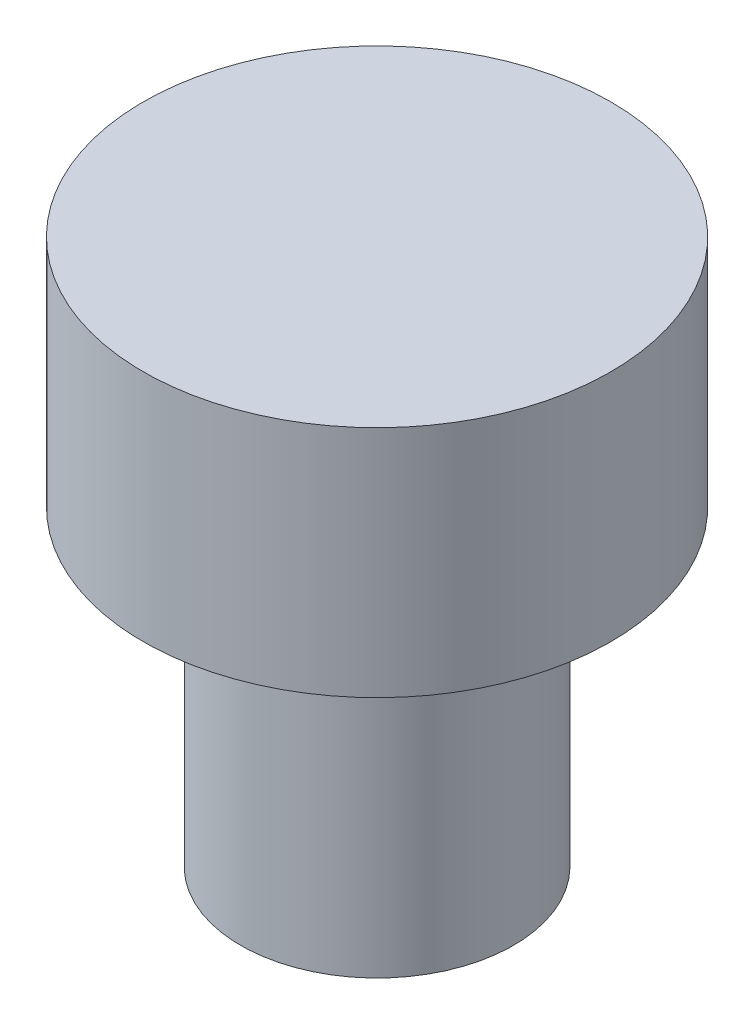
ISO-10303-21;
HEADER;
FILE_DESCRIPTION(('STEP AP214'),'2;1');
FILE_NAME('part.step','',(''),(''),'','','');
FILE_SCHEMA(('AUTOMOTIVE_DESIGN { 1 0 10303 214 1 1 1 1 }'));
ENDSEC;
DATA;
#1=APPLICATION_CONTEXT('core data for automotive mechanical design processes');
#2=APPLICATION_PROTOCOL_DEFINITION('international standard','automotive_design',2000,#1);
#3=PRODUCT_CONTEXT('',#1,'mechanical');
#4=PRODUCT('Part','Part','',(#3));
#5=PRODUCT_RELATED_PRODUCT_CATEGORY('part','',(#4));
#6=PRODUCT_DEFINITION_FORMATION('','',#4);
#7=PRODUCT_DEFINITION_CONTEXT('part definition',#1,'design');
#8=PRODUCT_DEFINITION('design','',#6,#7);
#9=PRODUCT_DEFINITION_SHAPE('','',#8);
#10=(LENGTH_UNIT() NAMED_UNIT(*) SI_UNIT(.MILLI.,.METRE.));
#11=(NAMED_UNIT(*) PLANE_ANGLE_UNIT() SI_UNIT($,.RADIAN.));
#12=(NAMED_UNIT(*) SI_UNIT($,.STERADIAN.) SOLID_ANGLE_UNIT());
#13=UNCERTAINTY_MEASURE_WITH_UNIT(LENGTH_MEASURE(1.E-05),#10,'distance_accuracy_value','');
#14=(GEOMETRIC_REPRESENTATION_CONTEXT(3) GLOBAL_UNCERTAINTY_ASSIGNED_CONTEXT((#13)) GLOBAL_UNIT_ASSIGNED_CONTEXT((#10,
#11,#12)) REPRESENTATION_CONTEXT('',''));
#15=CARTESIAN_POINT('',(0.,0.,0.));
#16=DIRECTION('',(0.,0.,1.));
#17=DIRECTION('',(1.,0.,0.));
#18=AXIS2_PLACEMENT_3D('',#15,#16,#17);
#19=CARTESIAN_POINT('',(0.,11.1125,0.));
#20=DIRECTION('',(0.,1.,0.));
#21=DIRECTION('',(0.,0.,1.));
#22=AXIS2_PLACEMENT_3D('',#19,#20,#21);
#23=PLANE('',#22);
#24=CARTESIAN_POINT('',(0.,11.1125,0.));
#25=DIRECTION('',(0.,-1.,0.));
#26=DIRECTION('',(0.,0.,-1.));
#27=AXIS2_PLACEMENT_3D('',#24,#25,#26);
#28=CIRCLE('',#27,4.7625);
#29=CARTESIAN_POINT('',(0.,11.1125,-4.76250000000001));
#30=VERTEX_POINT('',#29);
#31=EDGE_CURVE('E10',#30,#30,#28,.T.);
#32=ORIENTED_EDGE('',*,*,#31,.F.);
#33=EDGE_LOOP('',(#32));
#34=FACE_BOUND('',#33,.T.);
#35=ADVANCED_FACE('F34',(#34),#23,.T.);
#36=CARTESIAN_POINT('',(0.,0.,0.));
#37=DIRECTION('',(0.,-1.,0.));
#38=DIRECTION('',(0.,0.,-1.));
#39=AXIS2_PLACEMENT_3D('',#36,#37,#38);
#40=CYLINDRICAL_SURFACE('',#39,4.7625);
#41=ORIENTED_EDGE('',*,*,#31,.T.);
#42=EDGE_LOOP('',(#41));
#43=FACE_BOUND('',#42,.T.);
#44=CARTESIAN_POINT('',(0.,6.35,0.));
#45=DIRECTION('',(0.,-1.,0.));
#46=DIRECTION('',(0.,0.,-1.));
#47=AXIS2_PLACEMENT_3D('',#44,#45,#46);
#48=CIRCLE('',#47,4.7625);
#49=CARTESIAN_POINT('',(0.,6.35,-4.76250000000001));
#50=VERTEX_POINT('',#49);
#51=EDGE_CURVE('E40',#50,#50,#48,.T.);
#52=ORIENTED_EDGE('',*,*,#51,.F.);
#53=EDGE_LOOP('',(#52));
#54=FACE_BOUND('',#53,.T.);
#55=ADVANCED_FACE('F66',(#43,#54),#40,.T.);
#56=CARTESIAN_POINT('',(4.76250000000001,6.35,0.));
#57=DIRECTION('',(0.,-1.,0.));
#58=DIRECTION('',(0.,0.,-1.));
#59=AXIS2_PLACEMENT_3D('',#56,#57,#58);
#60=PLANE('',#59);
#61=ORIENTED_EDGE('',*,*,#51,.T.);
#62=EDGE_LOOP('',(#61));
#63=FACE_BOUND('',#62,.T.);
#64=CARTESIAN_POINT('',(0.,6.35,0.));
#65=DIRECTION('',(0.,-1.,0.));
#66=DIRECTION('',(0.,0.,-1.));
#67=AXIS2_PLACEMENT_3D('',#64,#65,#66);
#68=CIRCLE('',#67,2.778125);
#69=CARTESIAN_POINT('',(0.,6.35,-2.77812500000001));
#70=VERTEX_POINT('',#69);
#71=EDGE_CURVE('E44',#70,#70,#68,.T.);
#72=ORIENTED_EDGE('',*,*,#71,.F.);
#73=EDGE_LOOP('',(#72));
#74=FACE_BOUND('',#73,.T.);
#75=ADVANCED_FACE('F58',(#63,#74),#60,.T.);
#76=CARTESIAN_POINT('',(0.,0.,0.));
#77=DIRECTION('',(0.,-1.,0.));
#78=DIRECTION('',(0.,0.,-1.));
#79=AXIS2_PLACEMENT_3D('',#76,#77,#78);
#80=CYLINDRICAL_SURFACE('',#79,2.778125);
#81=ORIENTED_EDGE('',*,*,#71,.T.);
#82=EDGE_LOOP('',(#81));
#83=FACE_BOUND('',#82,.T.);
#84=CARTESIAN_POINT('',(0.,0.,0.));
#85=DIRECTION('',(0.,-1.,0.));
#86=DIRECTION('',(0.,0.,-1.));
#87=AXIS2_PLACEMENT_3D('',#84,#85,#86);
#88=CIRCLE('',#87,2.778125);
#89=CARTESIAN_POINT('',(0.,0.,-2.778125));
#90=VERTEX_POINT('',#89);
#91=EDGE_CURVE('E48',#90,#90,#88,.T.);
#92=ORIENTED_EDGE('',*,*,#91,.F.);
#93=EDGE_LOOP('',(#92));
#94=FACE_BOUND('',#93,.T.);
#95=ADVANCED_FACE('F56',(#83,#94),#80,.T.);
#96=CARTESIAN_POINT('',(2.778125,0.,0.));
#97=DIRECTION('',(0.,-1.,0.));
#98=DIRECTION('',(0.,0.,-1.));
#99=AXIS2_PLACEMENT_3D('',#96,#97,#98);
#100=PLANE('',#99);
#101=ORIENTED_EDGE('',*,*,#91,.T.);
#102=EDGE_LOOP('',(#101));
#103=FACE_BOUND('',#102,.T.);
#104=ADVANCED_FACE('F54',(#103),#100,.T.);
#105=CLOSED_SHELL('',(#35,#55,#75,#95,#104));
#106=MANIFOLD_SOLID_BREP('B2',#105);
#107=ADVANCED_BREP_SHAPE_REPRESENTATION('',(#18,#106),#14);
#108=SHAPE_DEFINITION_REPRESENTATION(#9,#107);
ENDSEC;
END-ISO-10303-21;
